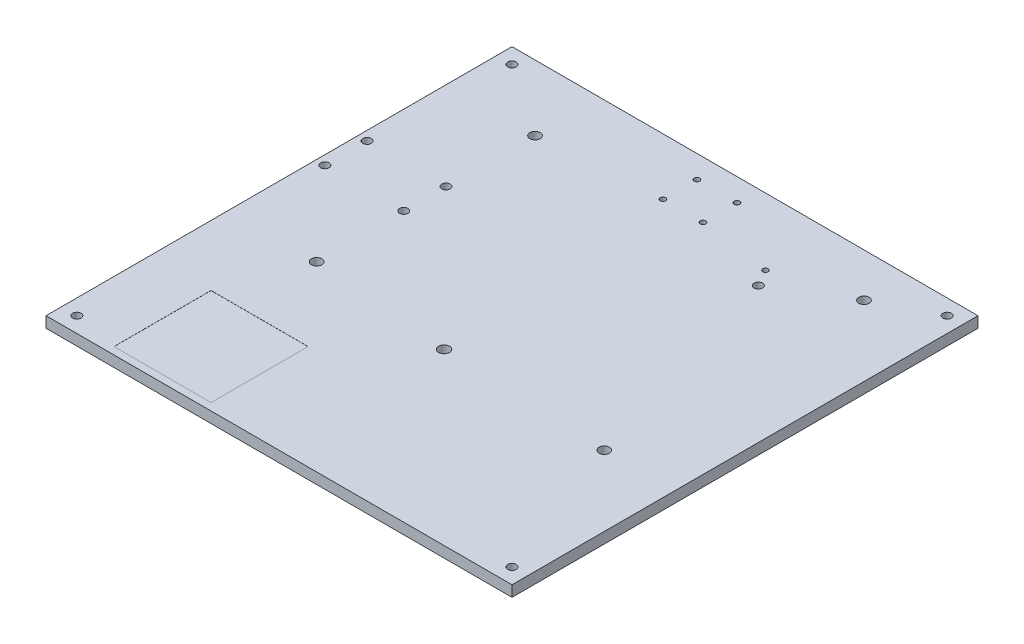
from build123d import *

# Parameters (mm, degrees)
SKETCH1_W           = 384
SKETCH1_H           = 384
SKETCH1_R           = 4.5
SKETCH1_R_2         = 4.3
SKETCH1_R_3         = 3.5
SKETCH1_R_4         = 2.2
SKETCH1_R_5         = 2.25
BOSS_EXTRUDE1_DEPTH = 9
SKETCH4_W           = 80
SKETCH4_H           = 80
CUT_EXTRUDE2_DEPTH  = 0.1


with BuildPart() as part:
    # Sketch1 → Boss-Extrude1 (new body)
    with BuildSketch(Plane(origin=(0, 0, 0), x_dir=(1, 0, 0), z_dir=(0, 1, 0))):
        with Locations((200.521738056, 210.472034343)):
            Rectangle(SKETCH1_W, SKETCH1_H)
        with Locations(Location((196.521738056, 158.472034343, 0), (0, 0, 270))):
            Circle(SKETCH1_R, mode=Mode.SUBTRACT)
        with Locations(Location((81.521738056, 348.472034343, 0), (0, 0, 270))):
            Circle(SKETCH1_R_2, mode=Mode.SUBTRACT)
        with Locations(Location((334.521738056, 152.472034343, 0), (0, 0, 270))):
            Circle(SKETCH1_R_2, mode=Mode.SUBTRACT)
        with Locations(Location((81.521738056, 168.472034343, 0), (0, 0, 270))):
            Circle(SKETCH1_R_2, mode=Mode.SUBTRACT)
        with Locations(Location((16.094347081, 240.696340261, 0), (0, 0, 270))):
            Circle(SKETCH1_R_3, mode=Mode.SUBTRACT)
        with Locations(Location((334.521738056, 366.472034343, 0), (0, 0, 270))):
            Circle(SKETCH1_R_2, mode=Mode.SUBTRACT)
        with Locations(Location((280.521738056, 333.472034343, 0), (0, 0, 270))):
            Circle(SKETCH1_R_3, mode=Mode.SUBTRACT)
        with Locations(Location((16.094347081, 275.472034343, 0), (0, 0, 270))):
            Circle(SKETCH1_R_3, mode=Mode.SUBTRACT)
        with Locations(Location((81.094347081, 275.472034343, 0), (0, 0, 270))):
            Circle(SKETCH1_R_3, mode=Mode.SUBTRACT)
        with Locations(Location((81.094347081, 240.696340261, 0), (0, 0, 270))):
            Circle(SKETCH1_R_3, mode=Mode.SUBTRACT)
        with Locations(Location((21.221738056, 389.772034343, 0), (0, 0, 270))):
            Circle(SKETCH1_R_3, mode=Mode.SUBTRACT)
        with Locations(Location((379.821738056, 389.772034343, 0), (0, 0, 270))):
            Circle(SKETCH1_R_3, mode=Mode.SUBTRACT)
        with Locations(Location((379.821738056, 31.172034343, 0), (0, 0, 270))):
            Circle(SKETCH1_R_3, mode=Mode.SUBTRACT)
        with Locations(Location((21.221738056, 31.172034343, 0), (0, 0, 270))):
            Circle(SKETCH1_R_3, mode=Mode.SUBTRACT)
        with Locations(Location((272.521738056, 347.328440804, 0), (0, 0, 270))):
            Circle(SKETCH1_R_4, mode=Mode.SUBTRACT)
        with Locations(Location((179.621738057, 383.772034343, 0), (0, 0, 270))):
            Circle(SKETCH1_R_5, mode=Mode.SUBTRACT)
        with Locations(Location((179.621738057, 355.772034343, 0), (0, 0, 270))):
            Circle(SKETCH1_R_5, mode=Mode.SUBTRACT)
        with Locations(Location((212.621738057, 355.772034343, 0), (0, 0, 270))):
            Circle(SKETCH1_R_5, mode=Mode.SUBTRACT)
        with Locations(Location((212.621738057, 383.772034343, 0), (0, 0, 270))):
            Circle(SKETCH1_R_5, mode=Mode.SUBTRACT)
    extrude(amount=BOSS_EXTRUDE1_DEPTH)

    # Sketch4 → Cut-Extrude2 (cut)
    with BuildSketch(Plane(origin=(0, 9, 0), x_dir=(1, 0, 0), z_dir=(0, 1, 0))):
        with Locations((98.521738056, 64.472034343)):
            Rectangle(SKETCH4_W, SKETCH4_H)
    extrude(amount=-CUT_EXTRUDE2_DEPTH, mode=Mode.SUBTRACT)


solid = part.part
